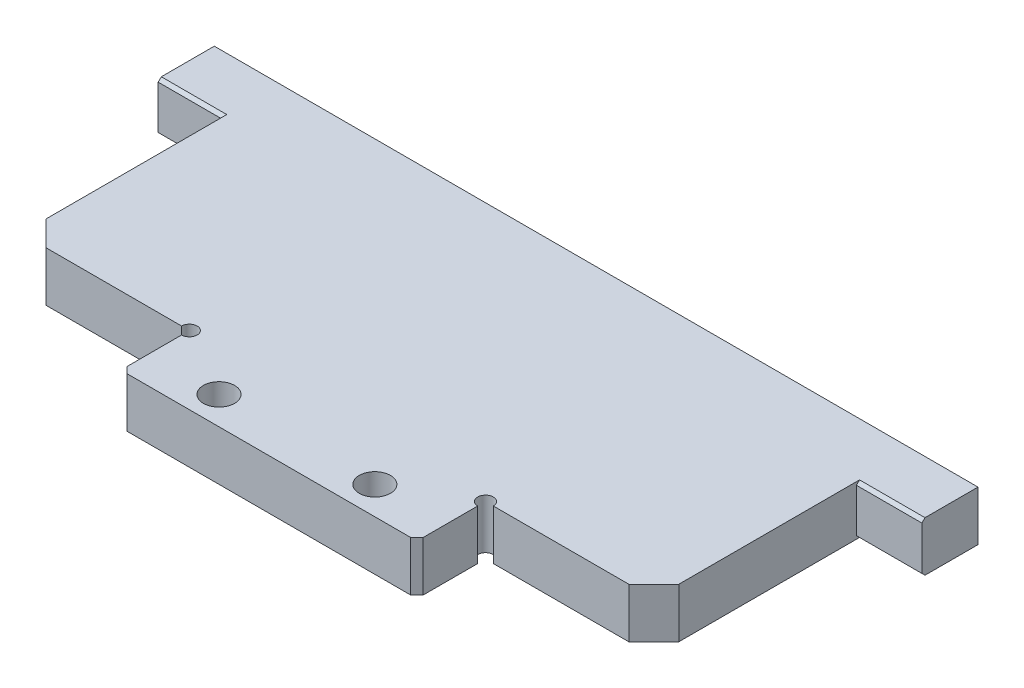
ISO-10303-21;
HEADER;
FILE_DESCRIPTION(('STEP AP214'),'2;1');
FILE_NAME('part.step','',(''),(''),'','','');
FILE_SCHEMA(('AUTOMOTIVE_DESIGN { 1 0 10303 214 1 1 1 1 }'));
ENDSEC;
DATA;
#1=APPLICATION_CONTEXT('core data for automotive mechanical design processes');
#2=APPLICATION_PROTOCOL_DEFINITION('international standard','automotive_design',2000,#1);
#3=PRODUCT_CONTEXT('',#1,'mechanical');
#4=PRODUCT('Part','Part','',(#3));
#5=PRODUCT_RELATED_PRODUCT_CATEGORY('part','',(#4));
#6=PRODUCT_DEFINITION_FORMATION('','',#4);
#7=PRODUCT_DEFINITION_CONTEXT('part definition',#1,'design');
#8=PRODUCT_DEFINITION('design','',#6,#7);
#9=PRODUCT_DEFINITION_SHAPE('','',#8);
#10=(LENGTH_UNIT() NAMED_UNIT(*) SI_UNIT(.MILLI.,.METRE.));
#11=(NAMED_UNIT(*) PLANE_ANGLE_UNIT() SI_UNIT($,.RADIAN.));
#12=(NAMED_UNIT(*) SI_UNIT($,.STERADIAN.) SOLID_ANGLE_UNIT());
#13=UNCERTAINTY_MEASURE_WITH_UNIT(LENGTH_MEASURE(1.E-05),#10,'distance_accuracy_value','');
#14=(GEOMETRIC_REPRESENTATION_CONTEXT(3) GLOBAL_UNCERTAINTY_ASSIGNED_CONTEXT((#13)) GLOBAL_UNIT_ASSIGNED_CONTEXT((#10,
#11,#12)) REPRESENTATION_CONTEXT('',''));
#15=CARTESIAN_POINT('',(0.,0.,0.));
#16=DIRECTION('',(0.,0.,1.));
#17=DIRECTION('',(1.,0.,0.));
#18=AXIS2_PLACEMENT_3D('',#15,#16,#17);
#19=CARTESIAN_POINT('',(-122.5,16.,-105.));
#20=DIRECTION('',(1.,0.,0.));
#21=DIRECTION('',(0.,0.,-1.));
#22=AXIS2_PLACEMENT_3D('',#19,#20,#21);
#23=PLANE('',#22);
#24=DIRECTION('',(0.,0.,1.));
#25=VECTOR('',#24,1.);
#26=CARTESIAN_POINT('',(-122.5,0.,-105.));
#27=LINE('',#26,#25);
#28=CARTESIAN_POINT('',(-122.5,0.,-105.));
#29=VERTEX_POINT('',#28);
#30=CARTESIAN_POINT('',(-122.5,0.,-88.));
#31=VERTEX_POINT('',#30);
#32=EDGE_CURVE('E250',#29,#31,#27,.T.);
#33=ORIENTED_EDGE('',*,*,#32,.T.);
#34=DIRECTION('',(0.,-0.707106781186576,-0.707106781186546));
#35=VECTOR('',#34,1.);
#36=CARTESIAN_POINT('',(-122.5,0.,-88.));
#37=LINE('',#36,#35);
#38=CARTESIAN_POINT('',(-122.5,1.,-87.));
#39=VERTEX_POINT('',#38);
#40=EDGE_CURVE('E348',#31,#39,#37,.F.);
#41=ORIENTED_EDGE('',*,*,#40,.T.);
#42=DIRECTION('',(0.,1.00000000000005,0.));
#43=VECTOR('',#42,1.);
#44=CARTESIAN_POINT('',(-122.5,0.,-87.));
#45=LINE('',#44,#43);
#46=CARTESIAN_POINT('',(-122.5,15.,-87.));
#47=VERTEX_POINT('',#46);
#48=EDGE_CURVE('E416',#39,#47,#45,.T.);
#49=ORIENTED_EDGE('',*,*,#48,.T.);
#50=DIRECTION('',(0.,0.707106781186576,-0.707106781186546));
#51=VECTOR('',#50,1.);
#52=CARTESIAN_POINT('',(-122.5,15.,-87.));
#53=LINE('',#52,#51);
#54=CARTESIAN_POINT('',(-122.5,16.,-88.));
#55=VERTEX_POINT('',#54);
#56=EDGE_CURVE('E346',#47,#55,#53,.T.);
#57=ORIENTED_EDGE('',*,*,#56,.T.);
#58=DIRECTION('',(0.,0.,1.));
#59=VECTOR('',#58,1.);
#60=CARTESIAN_POINT('',(-122.5,16.,-105.));
#61=LINE('',#60,#59);
#62=CARTESIAN_POINT('',(-122.5,16.,-105.));
#63=VERTEX_POINT('',#62);
#64=EDGE_CURVE('E255',#63,#55,#61,.T.);
#65=ORIENTED_EDGE('',*,*,#64,.F.);
#66=DIRECTION('',(0.,-1.00000000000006,0.));
#67=VECTOR('',#66,1.);
#68=CARTESIAN_POINT('',(-122.5,16.,-105.));
#69=LINE('',#68,#67);
#70=EDGE_CURVE('E267',#63,#29,#69,.T.);
#71=ORIENTED_EDGE('',*,*,#70,.T.);
#72=EDGE_LOOP('',(#33,#41,#49,#57,#65,#71));
#73=FACE_BOUND('',#72,.T.);
#74=ADVANCED_FACE('F54',(#73),#23,.F.);
#75=CARTESIAN_POINT('',(-122.5,16.,0.));
#76=DIRECTION('',(0.,0.,-1.));
#77=DIRECTION('',(-1.,0.,0.));
#78=AXIS2_PLACEMENT_3D('',#75,#76,#77);
#79=PLANE('',#78);
#80=DIRECTION('',(1.,0.,0.));
#81=VECTOR('',#80,1.);
#82=CARTESIAN_POINT('',(-122.5,16.,0.));
#83=LINE('',#82,#81);
#84=CARTESIAN_POINT('',(-45.5,16.,0.));
#85=VERTEX_POINT('',#84);
#86=CARTESIAN_POINT('',(45.5,16.,1.59160878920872E-13));
#87=VERTEX_POINT('',#86);
#88=EDGE_CURVE('E258',#85,#87,#83,.T.);
#89=ORIENTED_EDGE('',*,*,#88,.F.);
#90=DIRECTION('',(0.,-1.00000000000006,0.));
#91=VECTOR('',#90,1.);
#92=CARTESIAN_POINT('',(-45.5,16.,0.));
#93=LINE('',#92,#91);
#94=CARTESIAN_POINT('',(-45.5000000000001,0.,0.));
#95=VERTEX_POINT('',#94);
#96=EDGE_CURVE('E295',#85,#95,#93,.T.);
#97=ORIENTED_EDGE('',*,*,#96,.T.);
#98=DIRECTION('',(1.,0.,0.));
#99=VECTOR('',#98,1.);
#100=CARTESIAN_POINT('',(-122.5,0.,-1.0842021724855E-13));
#101=LINE('',#100,#99);
#102=CARTESIAN_POINT('',(45.5,0.,0.));
#103=VERTEX_POINT('',#102);
#104=EDGE_CURVE('E270',#95,#103,#101,.T.);
#105=ORIENTED_EDGE('',*,*,#104,.T.);
#106=DIRECTION('',(0.,1.00000000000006,0.));
#107=VECTOR('',#106,1.);
#108=CARTESIAN_POINT('',(45.5,16.,1.62630325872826E-13));
#109=LINE('',#108,#107);
#110=EDGE_CURVE('E292',#103,#87,#109,.T.);
#111=ORIENTED_EDGE('',*,*,#110,.T.);
#112=EDGE_LOOP('',(#89,#97,#105,#111));
#113=FACE_BOUND('',#112,.T.);
#114=ADVANCED_FACE('F443',(#113),#79,.F.);
#115=CARTESIAN_POINT('',(122.5,16.,-105.));
#116=DIRECTION('',(-1.,0.,0.));
#117=DIRECTION('',(0.,0.,1.));
#118=AXIS2_PLACEMENT_3D('',#115,#116,#117);
#119=PLANE('',#118);
#120=DIRECTION('',(0.,1.00000000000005,0.));
#121=VECTOR('',#120,1.);
#122=CARTESIAN_POINT('',(122.5,0.,-86.9999999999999));
#123=LINE('',#122,#121);
#124=CARTESIAN_POINT('',(122.5,1.,-86.9999999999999));
#125=VERTEX_POINT('',#124);
#126=CARTESIAN_POINT('',(122.5,15.,-86.9999999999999));
#127=VERTEX_POINT('',#126);
#128=EDGE_CURVE('E405',#125,#127,#123,.T.);
#129=ORIENTED_EDGE('',*,*,#128,.F.);
#130=DIRECTION('',(0.,0.707106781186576,0.707106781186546));
#131=VECTOR('',#130,1.);
#132=CARTESIAN_POINT('',(122.5,0.,-87.9999999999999));
#133=LINE('',#132,#131);
#134=CARTESIAN_POINT('',(122.5,0.,-88.));
#135=VERTEX_POINT('',#134);
#136=EDGE_CURVE('E338',#125,#135,#133,.F.);
#137=ORIENTED_EDGE('',*,*,#136,.T.);
#138=DIRECTION('',(0.,0.,-1.));
#139=VECTOR('',#138,1.);
#140=CARTESIAN_POINT('',(122.5,0.,-105.));
#141=LINE('',#140,#139);
#142=CARTESIAN_POINT('',(122.5,0.,-105.));
#143=VERTEX_POINT('',#142);
#144=EDGE_CURVE('E273',#135,#143,#141,.T.);
#145=ORIENTED_EDGE('',*,*,#144,.T.);
#146=DIRECTION('',(0.,-1.00000000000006,0.));
#147=VECTOR('',#146,1.);
#148=CARTESIAN_POINT('',(122.5,16.,-105.));
#149=LINE('',#148,#147);
#150=CARTESIAN_POINT('',(122.5,16.,-105.));
#151=VERTEX_POINT('',#150);
#152=EDGE_CURVE('E279',#151,#143,#149,.T.);
#153=ORIENTED_EDGE('',*,*,#152,.F.);
#154=DIRECTION('',(0.,0.,-1.));
#155=VECTOR('',#154,1.);
#156=CARTESIAN_POINT('',(122.5,16.,-105.));
#157=LINE('',#156,#155);
#158=CARTESIAN_POINT('',(122.5,16.,-88.));
#159=VERTEX_POINT('',#158);
#160=EDGE_CURVE('E261',#159,#151,#157,.T.);
#161=ORIENTED_EDGE('',*,*,#160,.F.);
#162=DIRECTION('',(0.,-0.707106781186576,0.707106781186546));
#163=VECTOR('',#162,1.);
#164=CARTESIAN_POINT('',(122.5,15.,-86.9999999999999));
#165=LINE('',#164,#163);
#166=EDGE_CURVE('E335',#159,#127,#165,.T.);
#167=ORIENTED_EDGE('',*,*,#166,.T.);
#168=EDGE_LOOP('',(#129,#137,#145,#153,#161,#167));
#169=FACE_BOUND('',#168,.T.);
#170=ADVANCED_FACE('F488',(#169),#119,.F.);
#171=CARTESIAN_POINT('',(-122.5,16.,-105.));
#172=DIRECTION('',(0.,0.,1.));
#173=DIRECTION('',(1.,0.,0.));
#174=AXIS2_PLACEMENT_3D('',#171,#172,#173);
#175=PLANE('',#174);
#176=DIRECTION('',(-1.,0.,0.));
#177=VECTOR('',#176,1.);
#178=CARTESIAN_POINT('',(-122.5,0.,-105.));
#179=LINE('',#178,#177);
#180=EDGE_CURVE('E259',#143,#29,#179,.T.);
#181=ORIENTED_EDGE('',*,*,#180,.T.);
#182=ORIENTED_EDGE('',*,*,#70,.F.);
#183=DIRECTION('',(-1.,0.,0.));
#184=VECTOR('',#183,1.);
#185=CARTESIAN_POINT('',(-122.5,16.,-105.));
#186=LINE('',#185,#184);
#187=EDGE_CURVE('E264',#151,#63,#186,.T.);
#188=ORIENTED_EDGE('',*,*,#187,.F.);
#189=ORIENTED_EDGE('',*,*,#152,.T.);
#190=EDGE_LOOP('',(#181,#182,#188,#189));
#191=FACE_BOUND('',#190,.T.);
#192=ADVANCED_FACE('F381',(#191),#175,.F.);
#193=CARTESIAN_POINT('',(0.,16.,1.0842021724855E-13));
#194=DIRECTION('',(0.,1.00000000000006,0.));
#195=DIRECTION('',(0.,0.,1.));
#196=AXIS2_PLACEMENT_3D('',#193,#194,#195);
#197=PLANE('',#196);
#198=DIRECTION('',(0.,0.,1.));
#199=VECTOR('',#198,1.);
#200=CARTESIAN_POINT('',(101.5,16.,-21.9999999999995));
#201=LINE('',#200,#199);
#202=CARTESIAN_POINT('',(101.5,16.,-88.));
#203=VERTEX_POINT('',#202);
#204=CARTESIAN_POINT('',(101.5,16.,-30.));
#205=VERTEX_POINT('',#204);
#206=EDGE_CURVE('E412',#203,#205,#201,.T.);
#207=ORIENTED_EDGE('',*,*,#206,.F.);
#208=DIRECTION('',(1.,0.,0.));
#209=VECTOR('',#208,1.);
#210=CARTESIAN_POINT('',(122.5,16.,-88.));
#211=LINE('',#210,#209);
#212=EDGE_CURVE('E343',#203,#159,#211,.T.);
#213=ORIENTED_EDGE('',*,*,#212,.T.);
#214=ORIENTED_EDGE('',*,*,#160,.T.);
#215=ORIENTED_EDGE('',*,*,#187,.T.);
#216=ORIENTED_EDGE('',*,*,#64,.T.);
#217=DIRECTION('',(1.,0.,0.));
#218=VECTOR('',#217,1.);
#219=CARTESIAN_POINT('',(-101.5,16.,-88.));
#220=LINE('',#219,#218);
#221=CARTESIAN_POINT('',(-101.5,16.,-88.));
#222=VERTEX_POINT('',#221);
#223=EDGE_CURVE('E340',#55,#222,#220,.T.);
#224=ORIENTED_EDGE('',*,*,#223,.T.);
#225=DIRECTION('',(0.,0.,-1.));
#226=VECTOR('',#225,1.);
#227=CARTESIAN_POINT('',(-101.5,16.,-22.));
#228=LINE('',#227,#226);
#229=CARTESIAN_POINT('',(-101.5,16.,-29.9999999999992));
#230=VERTEX_POINT('',#229);
#231=EDGE_CURVE('E404',#230,#222,#228,.T.);
#232=ORIENTED_EDGE('',*,*,#231,.F.);
#233=DIRECTION('',(-0.707106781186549,0.,-0.707106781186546));
#234=VECTOR('',#233,1.);
#235=CARTESIAN_POINT('',(-35.7499999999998,16.,35.7499999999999));
#236=LINE('',#235,#234);
#237=CARTESIAN_POINT('',(-93.4999999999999,16.,-22.));
#238=VERTEX_POINT('',#237);
#239=EDGE_CURVE('E306',#230,#238,#236,.F.);
#240=ORIENTED_EDGE('',*,*,#239,.T.);
#241=DIRECTION('',(-1.,0.,0.));
#242=VECTOR('',#241,1.);
#243=CARTESIAN_POINT('',(-122.5,16.,-22.));
#244=LINE('',#243,#242);
#245=CARTESIAN_POINT('',(-50.,16.,-22.));
#246=VERTEX_POINT('',#245);
#247=EDGE_CURVE('E247',#246,#238,#244,.T.);
#248=ORIENTED_EDGE('',*,*,#247,.F.);
#249=CARTESIAN_POINT('',(-47.5,16.,-22.));
#250=DIRECTION('',(0.,1.00000000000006,0.));
#251=DIRECTION('',(0.,0.,1.));
#252=AXIS2_PLACEMENT_3D('',#249,#250,#251);
#253=CIRCLE('',#252,2.50000000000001);
#254=CARTESIAN_POINT('',(-47.5,16.,-19.5));
#255=VERTEX_POINT('',#254);
#256=EDGE_CURVE('E230',#255,#246,#253,.T.);
#257=ORIENTED_EDGE('',*,*,#256,.F.);
#258=DIRECTION('',(0.,0.,-1.));
#259=VECTOR('',#258,1.);
#260=CARTESIAN_POINT('',(-47.5,16.,0.));
#261=LINE('',#260,#259);
#262=CARTESIAN_POINT('',(-47.5,16.,-1.9999999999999));
#263=VERTEX_POINT('',#262);
#264=EDGE_CURVE('E251',#263,#255,#261,.T.);
#265=ORIENTED_EDGE('',*,*,#264,.F.);
#266=DIRECTION('',(-0.707106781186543,0.,-0.707106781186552));
#267=VECTOR('',#266,1.);
#268=CARTESIAN_POINT('',(-22.7500000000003,16.,22.75));
#269=LINE('',#268,#267);
#270=EDGE_CURVE('E290',#263,#85,#269,.F.);
#271=ORIENTED_EDGE('',*,*,#270,.T.);
#272=ORIENTED_EDGE('',*,*,#88,.T.);
#273=DIRECTION('',(-0.707106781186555,0.,0.70710678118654));
#274=VECTOR('',#273,1.);
#275=CARTESIAN_POINT('',(22.7499999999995,16.,22.75));
#276=LINE('',#275,#274);
#277=CARTESIAN_POINT('',(47.5,16.,-1.99999999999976));
#278=VERTEX_POINT('',#277);
#279=EDGE_CURVE('E235',#87,#278,#276,.F.);
#280=ORIENTED_EDGE('',*,*,#279,.T.);
#281=DIRECTION('',(0.,0.,1.));
#282=VECTOR('',#281,1.);
#283=CARTESIAN_POINT('',(47.5,16.,1.62630325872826E-13));
#284=LINE('',#283,#282);
#285=CARTESIAN_POINT('',(47.5,16.,-19.5));
#286=VERTEX_POINT('',#285);
#287=EDGE_CURVE('E226',#286,#278,#284,.T.);
#288=ORIENTED_EDGE('',*,*,#287,.F.);
#289=CARTESIAN_POINT('',(47.5,16.,-22.));
#290=DIRECTION('',(0.,1.00000000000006,0.));
#291=DIRECTION('',(0.,0.,1.));
#292=AXIS2_PLACEMENT_3D('',#289,#290,#291);
#293=CIRCLE('',#292,2.50000000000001);
#294=CARTESIAN_POINT('',(50.,16.,-22.));
#295=VERTEX_POINT('',#294);
#296=EDGE_CURVE('E208',#295,#286,#293,.T.);
#297=ORIENTED_EDGE('',*,*,#296,.F.);
#298=DIRECTION('',(-1.,0.,0.));
#299=VECTOR('',#298,1.);
#300=CARTESIAN_POINT('',(122.5,16.,-22.));
#301=LINE('',#300,#299);
#302=CARTESIAN_POINT('',(93.5000000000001,16.,-21.9999999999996));
#303=VERTEX_POINT('',#302);
#304=EDGE_CURVE('E237',#303,#295,#301,.T.);
#305=ORIENTED_EDGE('',*,*,#304,.F.);
#306=DIRECTION('',(-0.707106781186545,0.,0.70710678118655));
#307=VECTOR('',#306,1.);
#308=CARTESIAN_POINT('',(35.7500000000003,16.,35.7500000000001));
#309=LINE('',#308,#307);
#310=EDGE_CURVE('E308',#303,#205,#309,.F.);
#311=ORIENTED_EDGE('',*,*,#310,.T.);
#312=EDGE_LOOP('',(#207,#213,#214,#215,#216,#224,#232,#240,#248,#257,#265,#271,#272,#280,#288,
#297,#305,#311));
#313=FACE_BOUND('',#312,.T.);
#314=CARTESIAN_POINT('',(25.,16.,-9.));
#315=DIRECTION('',(0.,1.00000000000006,0.));
#316=DIRECTION('',(0.,0.,1.));
#317=AXIS2_PLACEMENT_3D('',#314,#315,#316);
#318=CIRCLE('',#317,5.);
#319=CARTESIAN_POINT('',(25.,16.,-4.));
#320=VERTEX_POINT('',#319);
#321=EDGE_CURVE('E418',#320,#320,#318,.T.);
#322=ORIENTED_EDGE('',*,*,#321,.F.);
#323=EDGE_LOOP('',(#322));
#324=FACE_BOUND('',#323,.T.);
#325=CARTESIAN_POINT('',(-25.,16.,-9.));
#326=DIRECTION('',(0.,1.00000000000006,0.));
#327=DIRECTION('',(0.,0.,1.));
#328=AXIS2_PLACEMENT_3D('',#325,#326,#327);
#329=CIRCLE('',#328,5.);
#330=CARTESIAN_POINT('',(-25.,16.,-4.));
#331=VERTEX_POINT('',#330);
#332=EDGE_CURVE('E423',#331,#331,#329,.T.);
#333=ORIENTED_EDGE('',*,*,#332,.F.);
#334=EDGE_LOOP('',(#333));
#335=FACE_BOUND('',#334,.T.);
#336=ADVANCED_FACE('F232',(#313,#324,#335),#197,.T.);
#337=CARTESIAN_POINT('',(0.,0.,0.));
#338=DIRECTION('',(0.,1.00000000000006,0.));
#339=DIRECTION('',(0.,0.,1.));
#340=AXIS2_PLACEMENT_3D('',#337,#338,#339);
#341=PLANE('',#340);
#342=CARTESIAN_POINT('',(25.,0.,-9.));
#343=DIRECTION('',(0.,1.00000000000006,0.));
#344=DIRECTION('',(0.,0.,1.));
#345=AXIS2_PLACEMENT_3D('',#342,#343,#344);
#346=CIRCLE('',#345,5.);
#347=CARTESIAN_POINT('',(25.,0.,-4.));
#348=VERTEX_POINT('',#347);
#349=EDGE_CURVE('E420',#348,#348,#346,.T.);
#350=ORIENTED_EDGE('',*,*,#349,.T.);
#351=EDGE_LOOP('',(#350));
#352=FACE_BOUND('',#351,.T.);
#353=CARTESIAN_POINT('',(-25.,0.,-9.));
#354=DIRECTION('',(0.,1.00000000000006,0.));
#355=DIRECTION('',(0.,0.,1.));
#356=AXIS2_PLACEMENT_3D('',#353,#354,#355);
#357=CIRCLE('',#356,5.);
#358=CARTESIAN_POINT('',(-25.,0.,-4.));
#359=VERTEX_POINT('',#358);
#360=EDGE_CURVE('E220',#359,#359,#357,.T.);
#361=ORIENTED_EDGE('',*,*,#360,.T.);
#362=EDGE_LOOP('',(#361));
#363=FACE_BOUND('',#362,.T.);
#364=ORIENTED_EDGE('',*,*,#144,.F.);
#365=DIRECTION('',(-1.,0.,0.));
#366=VECTOR('',#365,1.);
#367=CARTESIAN_POINT('',(0.,0.,-87.9999999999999));
#368=LINE('',#367,#366);
#369=CARTESIAN_POINT('',(101.5,0.,-87.9999999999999));
#370=VERTEX_POINT('',#369);
#371=EDGE_CURVE('E324',#135,#370,#368,.T.);
#372=ORIENTED_EDGE('',*,*,#371,.T.);
#373=DIRECTION('',(0.,0.,1.));
#374=VECTOR('',#373,1.);
#375=CARTESIAN_POINT('',(101.5,0.,-22.));
#376=LINE('',#375,#374);
#377=CARTESIAN_POINT('',(101.5,0.,-30.0000000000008));
#378=VERTEX_POINT('',#377);
#379=EDGE_CURVE('E397',#370,#378,#376,.T.);
#380=ORIENTED_EDGE('',*,*,#379,.T.);
#381=DIRECTION('',(0.707106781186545,0.,-0.70710678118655));
#382=VECTOR('',#381,1.);
#383=CARTESIAN_POINT('',(93.5,0.,-21.9999999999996));
#384=LINE('',#383,#382);
#385=CARTESIAN_POINT('',(93.5000000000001,0.,-21.9999999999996));
#386=VERTEX_POINT('',#385);
#387=EDGE_CURVE('E314',#378,#386,#384,.F.);
#388=ORIENTED_EDGE('',*,*,#387,.T.);
#389=DIRECTION('',(-1.,0.,0.));
#390=VECTOR('',#389,1.);
#391=CARTESIAN_POINT('',(122.5,0.,-22.));
#392=LINE('',#391,#390);
#393=CARTESIAN_POINT('',(50.,0.,-22.));
#394=VERTEX_POINT('',#393);
#395=EDGE_CURVE('E236',#386,#394,#392,.T.);
#396=ORIENTED_EDGE('',*,*,#395,.T.);
#397=CARTESIAN_POINT('',(47.5,0.,-22.));
#398=DIRECTION('',(0.,1.00000000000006,0.));
#399=DIRECTION('',(0.,0.,1.));
#400=AXIS2_PLACEMENT_3D('',#397,#398,#399);
#401=CIRCLE('',#400,2.50000000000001);
#402=CARTESIAN_POINT('',(47.5,0.,-19.5));
#403=VERTEX_POINT('',#402);
#404=EDGE_CURVE('E219',#394,#403,#401,.T.);
#405=ORIENTED_EDGE('',*,*,#404,.T.);
#406=DIRECTION('',(0.,0.,1.));
#407=VECTOR('',#406,1.);
#408=CARTESIAN_POINT('',(47.5,0.,0.));
#409=LINE('',#408,#407);
#410=CARTESIAN_POINT('',(47.5,0.,-1.99999999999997));
#411=VERTEX_POINT('',#410);
#412=EDGE_CURVE('E229',#403,#411,#409,.T.);
#413=ORIENTED_EDGE('',*,*,#412,.T.);
#414=DIRECTION('',(0.707106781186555,0.,-0.70710678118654));
#415=VECTOR('',#414,1.);
#416=CARTESIAN_POINT('',(45.5,0.,0.));
#417=LINE('',#416,#415);
#418=EDGE_CURVE('E297',#411,#103,#417,.F.);
#419=ORIENTED_EDGE('',*,*,#418,.T.);
#420=ORIENTED_EDGE('',*,*,#104,.F.);
#421=DIRECTION('',(0.707106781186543,0.,0.707106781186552));
#422=VECTOR('',#421,1.);
#423=CARTESIAN_POINT('',(-47.5,0.,-2.));
#424=LINE('',#423,#422);
#425=CARTESIAN_POINT('',(-47.5,0.,-2.));
#426=VERTEX_POINT('',#425);
#427=EDGE_CURVE('E299',#95,#426,#424,.F.);
#428=ORIENTED_EDGE('',*,*,#427,.T.);
#429=DIRECTION('',(0.,0.,-1.));
#430=VECTOR('',#429,1.);
#431=CARTESIAN_POINT('',(-47.5,0.,0.));
#432=LINE('',#431,#430);
#433=CARTESIAN_POINT('',(-47.5,0.,-19.5));
#434=VERTEX_POINT('',#433);
#435=EDGE_CURVE('E244',#426,#434,#432,.T.);
#436=ORIENTED_EDGE('',*,*,#435,.T.);
#437=CARTESIAN_POINT('',(-47.5,0.,-22.));
#438=DIRECTION('',(0.,1.00000000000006,0.));
#439=DIRECTION('',(0.,0.,1.));
#440=AXIS2_PLACEMENT_3D('',#437,#438,#439);
#441=CIRCLE('',#440,2.50000000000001);
#442=CARTESIAN_POINT('',(-50.,0.,-22.));
#443=VERTEX_POINT('',#442);
#444=EDGE_CURVE('E431',#434,#443,#441,.T.);
#445=ORIENTED_EDGE('',*,*,#444,.T.);
#446=DIRECTION('',(-1.,0.,0.));
#447=VECTOR('',#446,1.);
#448=CARTESIAN_POINT('',(-122.5,0.,-22.));
#449=LINE('',#448,#447);
#450=CARTESIAN_POINT('',(-93.4999999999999,0.,-22.0000000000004));
#451=VERTEX_POINT('',#450);
#452=EDGE_CURVE('E246',#443,#451,#449,.T.);
#453=ORIENTED_EDGE('',*,*,#452,.T.);
#454=DIRECTION('',(0.707106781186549,0.,0.707106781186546));
#455=VECTOR('',#454,1.);
#456=CARTESIAN_POINT('',(-101.5,0.,-30.));
#457=LINE('',#456,#455);
#458=CARTESIAN_POINT('',(-101.5,0.,-30.));
#459=VERTEX_POINT('',#458);
#460=EDGE_CURVE('E312',#451,#459,#457,.F.);
#461=ORIENTED_EDGE('',*,*,#460,.T.);
#462=DIRECTION('',(0.,0.,-1.));
#463=VECTOR('',#462,1.);
#464=CARTESIAN_POINT('',(-101.5,0.,-22.));
#465=LINE('',#464,#463);
#466=CARTESIAN_POINT('',(-101.5,0.,-88.));
#467=VERTEX_POINT('',#466);
#468=EDGE_CURVE('E365',#459,#467,#465,.T.);
#469=ORIENTED_EDGE('',*,*,#468,.T.);
#470=DIRECTION('',(-1.,0.,0.));
#471=VECTOR('',#470,1.);
#472=CARTESIAN_POINT('',(0.,0.,-88.));
#473=LINE('',#472,#471);
#474=EDGE_CURVE('E321',#467,#31,#473,.T.);
#475=ORIENTED_EDGE('',*,*,#474,.T.);
#476=ORIENTED_EDGE('',*,*,#32,.F.);
#477=ORIENTED_EDGE('',*,*,#180,.F.);
#478=EDGE_LOOP('',(#364,#372,#380,#388,#396,#405,#413,#419,#420,#428,#436,#445,#453,#461,#469,
#475,#476,#477));
#479=FACE_BOUND('',#478,.T.);
#480=ADVANCED_FACE('F373',(#352,#363,#479),#341,.F.);
#481=CARTESIAN_POINT('',(-122.5,0.,-22.));
#482=DIRECTION('',(0.,0.,-1.));
#483=DIRECTION('',(-1.,0.,0.));
#484=AXIS2_PLACEMENT_3D('',#481,#482,#483);
#485=PLANE('',#484);
#486=ORIENTED_EDGE('',*,*,#247,.T.);
#487=DIRECTION('',(0.,-1.00000000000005,0.));
#488=VECTOR('',#487,1.);
#489=CARTESIAN_POINT('',(-93.4999999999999,0.,-22.0000000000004));
#490=LINE('',#489,#488);
#491=EDGE_CURVE('E319',#238,#451,#490,.T.);
#492=ORIENTED_EDGE('',*,*,#491,.T.);
#493=ORIENTED_EDGE('',*,*,#452,.F.);
#494=DIRECTION('',(0.,1.00000000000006,0.));
#495=VECTOR('',#494,1.);
#496=CARTESIAN_POINT('',(-50.,0.,-22.));
#497=LINE('',#496,#495);
#498=EDGE_CURVE('E240',#443,#246,#497,.T.);
#499=ORIENTED_EDGE('',*,*,#498,.T.);
#500=EDGE_LOOP('',(#486,#492,#493,#499));
#501=FACE_BOUND('',#500,.T.);
#502=ADVANCED_FACE('F461',(#501),#485,.F.);
#503=CARTESIAN_POINT('',(-47.5,0.,0.));
#504=DIRECTION('',(1.,0.,0.));
#505=DIRECTION('',(0.,0.,-1.));
#506=AXIS2_PLACEMENT_3D('',#503,#504,#505);
#507=PLANE('',#506);
#508=ORIENTED_EDGE('',*,*,#435,.F.);
#509=DIRECTION('',(0.,1.00000000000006,0.));
#510=VECTOR('',#509,1.);
#511=CARTESIAN_POINT('',(-47.5,0.,-2.));
#512=LINE('',#511,#510);
#513=EDGE_CURVE('E286',#426,#263,#512,.T.);
#514=ORIENTED_EDGE('',*,*,#513,.T.);
#515=ORIENTED_EDGE('',*,*,#264,.T.);
#516=DIRECTION('',(0.,1.00000000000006,0.));
#517=VECTOR('',#516,1.);
#518=CARTESIAN_POINT('',(-47.5,0.,-19.5));
#519=LINE('',#518,#517);
#520=EDGE_CURVE('E282',#255,#434,#519,.F.);
#521=ORIENTED_EDGE('',*,*,#520,.T.);
#522=EDGE_LOOP('',(#508,#514,#515,#521));
#523=FACE_BOUND('',#522,.T.);
#524=ADVANCED_FACE('F453',(#523),#507,.F.);
#525=CARTESIAN_POINT('',(47.5,0.,0.));
#526=DIRECTION('',(-1.,0.,0.));
#527=DIRECTION('',(0.,0.,1.));
#528=AXIS2_PLACEMENT_3D('',#525,#526,#527);
#529=PLANE('',#528);
#530=ORIENTED_EDGE('',*,*,#287,.T.);
#531=DIRECTION('',(0.,-1.00000000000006,0.));
#532=VECTOR('',#531,1.);
#533=CARTESIAN_POINT('',(47.5,0.,-1.99999999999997));
#534=LINE('',#533,#532);
#535=EDGE_CURVE('E301',#278,#411,#534,.T.);
#536=ORIENTED_EDGE('',*,*,#535,.T.);
#537=ORIENTED_EDGE('',*,*,#412,.F.);
#538=DIRECTION('',(0.,1.00000000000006,0.));
#539=VECTOR('',#538,1.);
#540=CARTESIAN_POINT('',(47.5,0.,-19.5));
#541=LINE('',#540,#539);
#542=EDGE_CURVE('E212',#403,#286,#541,.T.);
#543=ORIENTED_EDGE('',*,*,#542,.T.);
#544=EDGE_LOOP('',(#530,#536,#537,#543));
#545=FACE_BOUND('',#544,.T.);
#546=ADVANCED_FACE('F225',(#545),#529,.F.);
#547=CARTESIAN_POINT('',(122.5,0.,-22.));
#548=DIRECTION('',(0.,0.,-1.));
#549=DIRECTION('',(-1.,0.,0.));
#550=AXIS2_PLACEMENT_3D('',#547,#548,#549);
#551=PLANE('',#550);
#552=ORIENTED_EDGE('',*,*,#395,.F.);
#553=DIRECTION('',(0.,1.00000000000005,0.));
#554=VECTOR('',#553,1.);
#555=CARTESIAN_POINT('',(93.5,0.,-21.9999999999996));
#556=LINE('',#555,#554);
#557=EDGE_CURVE('E303',#386,#303,#556,.T.);
#558=ORIENTED_EDGE('',*,*,#557,.T.);
#559=ORIENTED_EDGE('',*,*,#304,.T.);
#560=DIRECTION('',(0.,1.00000000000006,0.));
#561=VECTOR('',#560,1.);
#562=CARTESIAN_POINT('',(50.,0.,-22.));
#563=LINE('',#562,#561);
#564=EDGE_CURVE('E215',#295,#394,#563,.F.);
#565=ORIENTED_EDGE('',*,*,#564,.T.);
#566=EDGE_LOOP('',(#552,#558,#559,#565));
#567=FACE_BOUND('',#566,.T.);
#568=ADVANCED_FACE('F581',(#567),#551,.F.);
#569=CARTESIAN_POINT('',(-47.5,0.,-22.));
#570=DIRECTION('',(0.,1.00000000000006,0.));
#571=DIRECTION('',(0.,0.,1.));
#572=AXIS2_PLACEMENT_3D('',#569,#570,#571);
#573=CYLINDRICAL_SURFACE('',#572,2.50000000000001);
#574=ORIENTED_EDGE('',*,*,#444,.F.);
#575=ORIENTED_EDGE('',*,*,#520,.F.);
#576=ORIENTED_EDGE('',*,*,#256,.T.);
#577=ORIENTED_EDGE('',*,*,#498,.F.);
#578=EDGE_LOOP('',(#574,#575,#576,#577));
#579=FACE_BOUND('',#578,.T.);
#580=ADVANCED_FACE('F458',(#579),#573,.F.);
#581=CARTESIAN_POINT('',(47.5,0.,-22.));
#582=DIRECTION('',(0.,1.00000000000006,0.));
#583=DIRECTION('',(0.,0.,1.));
#584=AXIS2_PLACEMENT_3D('',#581,#582,#583);
#585=CYLINDRICAL_SURFACE('',#584,2.50000000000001);
#586=ORIENTED_EDGE('',*,*,#404,.F.);
#587=ORIENTED_EDGE('',*,*,#564,.F.);
#588=ORIENTED_EDGE('',*,*,#296,.T.);
#589=ORIENTED_EDGE('',*,*,#542,.F.);
#590=EDGE_LOOP('',(#586,#587,#588,#589));
#591=FACE_BOUND('',#590,.T.);
#592=ADVANCED_FACE('F211',(#591),#585,.F.);
#593=CARTESIAN_POINT('',(-47.5,0.,-2.));
#594=DIRECTION('',(0.707106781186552,0.,-0.707106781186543));
#595=DIRECTION('',(0.,1.00000000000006,0.));
#596=AXIS2_PLACEMENT_3D('',#593,#594,#595);
#597=PLANE('',#596);
#598=ORIENTED_EDGE('',*,*,#427,.F.);
#599=ORIENTED_EDGE('',*,*,#96,.F.);
#600=ORIENTED_EDGE('',*,*,#270,.F.);
#601=ORIENTED_EDGE('',*,*,#513,.F.);
#602=EDGE_LOOP('',(#598,#599,#600,#601));
#603=FACE_BOUND('',#602,.T.);
#604=ADVANCED_FACE('F450',(#603),#597,.F.);
#605=CARTESIAN_POINT('',(45.5,16.,1.62630325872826E-13));
#606=DIRECTION('',(-0.70710678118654,0.,-0.707106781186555));
#607=DIRECTION('',(0.,1.00000000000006,0.));
#608=AXIS2_PLACEMENT_3D('',#605,#606,#607);
#609=PLANE('',#608);
#610=ORIENTED_EDGE('',*,*,#418,.F.);
#611=ORIENTED_EDGE('',*,*,#535,.F.);
#612=ORIENTED_EDGE('',*,*,#279,.F.);
#613=ORIENTED_EDGE('',*,*,#110,.F.);
#614=EDGE_LOOP('',(#610,#611,#612,#613));
#615=FACE_BOUND('',#614,.T.);
#616=ADVANCED_FACE('F440',(#615),#609,.F.);
#617=CARTESIAN_POINT('',(-25.,0.,-9.));
#618=DIRECTION('',(0.,1.00000000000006,0.));
#619=DIRECTION('',(0.,0.,1.));
#620=AXIS2_PLACEMENT_3D('',#617,#618,#619);
#621=CYLINDRICAL_SURFACE('',#620,5.);
#622=ORIENTED_EDGE('',*,*,#360,.F.);
#623=EDGE_LOOP('',(#622));
#624=FACE_BOUND('',#623,.T.);
#625=ORIENTED_EDGE('',*,*,#332,.T.);
#626=EDGE_LOOP('',(#625));
#627=FACE_BOUND('',#626,.T.);
#628=ADVANCED_FACE('F479',(#624,#627),#621,.F.);
#629=CARTESIAN_POINT('',(25.,0.,-9.));
#630=DIRECTION('',(0.,1.00000000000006,0.));
#631=DIRECTION('',(0.,0.,1.));
#632=AXIS2_PLACEMENT_3D('',#629,#630,#631);
#633=CYLINDRICAL_SURFACE('',#632,5.);
#634=ORIENTED_EDGE('',*,*,#349,.F.);
#635=EDGE_LOOP('',(#634));
#636=FACE_BOUND('',#635,.T.);
#637=ORIENTED_EDGE('',*,*,#321,.T.);
#638=EDGE_LOOP('',(#637));
#639=FACE_BOUND('',#638,.T.);
#640=ADVANCED_FACE('F472',(#636,#639),#633,.F.);
#641=CARTESIAN_POINT('',(-122.5,0.,-87.));
#642=DIRECTION('',(0.,0.,-1.));
#643=DIRECTION('',(0.,1.00000000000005,0.));
#644=AXIS2_PLACEMENT_3D('',#641,#642,#643);
#645=PLANE('',#644);
#646=ORIENTED_EDGE('',*,*,#48,.F.);
#647=DIRECTION('',(1.,0.,0.));
#648=VECTOR('',#647,1.);
#649=CARTESIAN_POINT('',(-122.5,1.,-87.));
#650=LINE('',#649,#648);
#651=CARTESIAN_POINT('',(-101.5,1.,-87.));
#652=VERTEX_POINT('',#651);
#653=EDGE_CURVE('E74',#39,#652,#650,.T.);
#654=ORIENTED_EDGE('',*,*,#653,.T.);
#655=DIRECTION('',(0.,1.00000000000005,0.));
#656=VECTOR('',#655,1.);
#657=CARTESIAN_POINT('',(-101.5,0.,-87.));
#658=LINE('',#657,#656);
#659=CARTESIAN_POINT('',(-101.5,15.,-87.));
#660=VERTEX_POINT('',#659);
#661=EDGE_CURVE('E367',#652,#660,#658,.T.);
#662=ORIENTED_EDGE('',*,*,#661,.T.);
#663=DIRECTION('',(-1.,0.,0.));
#664=VECTOR('',#663,1.);
#665=CARTESIAN_POINT('',(-122.5,15.,-87.));
#666=LINE('',#665,#664);
#667=EDGE_CURVE('E350',#660,#47,#666,.T.);
#668=ORIENTED_EDGE('',*,*,#667,.T.);
#669=EDGE_LOOP('',(#646,#654,#662,#668));
#670=FACE_BOUND('',#669,.T.);
#671=ADVANCED_FACE('F470',(#670),#645,.F.);
#672=CARTESIAN_POINT('',(-101.5,0.,-22.));
#673=DIRECTION('',(1.,0.,0.));
#674=DIRECTION('',(0.,1.00000000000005,0.));
#675=AXIS2_PLACEMENT_3D('',#672,#673,#674);
#676=PLANE('',#675);
#677=ORIENTED_EDGE('',*,*,#468,.F.);
#678=DIRECTION('',(0.,1.00000000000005,0.));
#679=VECTOR('',#678,1.);
#680=CARTESIAN_POINT('',(-101.5,0.,-30.));
#681=LINE('',#680,#679);
#682=EDGE_CURVE('E316',#459,#230,#681,.T.);
#683=ORIENTED_EDGE('',*,*,#682,.T.);
#684=ORIENTED_EDGE('',*,*,#231,.T.);
#685=DIRECTION('',(0.,-0.707106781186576,0.707106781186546));
#686=VECTOR('',#685,1.);
#687=CARTESIAN_POINT('',(-101.5,-25.0000000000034,-47.0000000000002));
#688=LINE('',#687,#686);
#689=EDGE_CURVE('E13',#222,#660,#688,.T.);
#690=ORIENTED_EDGE('',*,*,#689,.T.);
#691=ORIENTED_EDGE('',*,*,#661,.F.);
#692=DIRECTION('',(0.,0.707106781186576,0.707106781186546));
#693=VECTOR('',#692,1.);
#694=CARTESIAN_POINT('',(-101.5,33.0000000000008,-55.0000000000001));
#695=LINE('',#694,#693);
#696=EDGE_CURVE('E62',#652,#467,#695,.F.);
#697=ORIENTED_EDGE('',*,*,#696,.T.);
#698=EDGE_LOOP('',(#677,#683,#684,#690,#691,#697));
#699=FACE_BOUND('',#698,.T.);
#700=ADVANCED_FACE('F364',(#699),#676,.F.);
#701=CARTESIAN_POINT('',(101.5,0.,-22.));
#702=DIRECTION('',(-1.,0.,0.));
#703=DIRECTION('',(0.,0.,1.));
#704=AXIS2_PLACEMENT_3D('',#701,#702,#703);
#705=PLANE('',#704);
#706=ORIENTED_EDGE('',*,*,#206,.T.);
#707=DIRECTION('',(0.,-1.00000000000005,0.));
#708=VECTOR('',#707,1.);
#709=CARTESIAN_POINT('',(101.5,0.,-30.0000000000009));
#710=LINE('',#709,#708);
#711=EDGE_CURVE('E310',#205,#378,#710,.T.);
#712=ORIENTED_EDGE('',*,*,#711,.T.);
#713=ORIENTED_EDGE('',*,*,#379,.F.);
#714=DIRECTION('',(0.,-0.707106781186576,-0.707106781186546));
#715=VECTOR('',#714,1.);
#716=CARTESIAN_POINT('',(101.5,33.0000000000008,-55.0000000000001));
#717=LINE('',#716,#715);
#718=CARTESIAN_POINT('',(101.5,1.,-86.9999999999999));
#719=VERTEX_POINT('',#718);
#720=EDGE_CURVE('E354',#370,#719,#717,.F.);
#721=ORIENTED_EDGE('',*,*,#720,.T.);
#722=DIRECTION('',(0.,1.00000000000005,0.));
#723=VECTOR('',#722,1.);
#724=CARTESIAN_POINT('',(101.5,0.,-86.9999999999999));
#725=LINE('',#724,#723);
#726=CARTESIAN_POINT('',(101.5,15.,-86.9999999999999));
#727=VERTEX_POINT('',#726);
#728=EDGE_CURVE('E396',#719,#727,#725,.T.);
#729=ORIENTED_EDGE('',*,*,#728,.T.);
#730=DIRECTION('',(0.,0.707106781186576,-0.707106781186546));
#731=VECTOR('',#730,1.);
#732=CARTESIAN_POINT('',(101.5,-25.0000000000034,-47.0000000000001));
#733=LINE('',#732,#731);
#734=EDGE_CURVE('E357',#727,#203,#733,.T.);
#735=ORIENTED_EDGE('',*,*,#734,.T.);
#736=EDGE_LOOP('',(#706,#712,#713,#721,#729,#735));
#737=FACE_BOUND('',#736,.T.);
#738=ADVANCED_FACE('F395',(#737),#705,.F.);
#739=CARTESIAN_POINT('',(122.5,0.,-86.9999999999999));
#740=DIRECTION('',(0.,0.,-1.));
#741=DIRECTION('',(0.,1.00000000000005,0.));
#742=AXIS2_PLACEMENT_3D('',#739,#740,#741);
#743=PLANE('',#742);
#744=ORIENTED_EDGE('',*,*,#728,.F.);
#745=DIRECTION('',(1.,0.,0.));
#746=VECTOR('',#745,1.);
#747=CARTESIAN_POINT('',(122.5,1.,-86.9999999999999));
#748=LINE('',#747,#746);
#749=EDGE_CURVE('E332',#719,#125,#748,.T.);
#750=ORIENTED_EDGE('',*,*,#749,.T.);
#751=ORIENTED_EDGE('',*,*,#128,.T.);
#752=DIRECTION('',(-1.,0.,0.));
#753=VECTOR('',#752,1.);
#754=CARTESIAN_POINT('',(101.5,15.,-86.9999999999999));
#755=LINE('',#754,#753);
#756=EDGE_CURVE('E328',#127,#727,#755,.T.);
#757=ORIENTED_EDGE('',*,*,#756,.T.);
#758=EDGE_LOOP('',(#744,#750,#751,#757));
#759=FACE_BOUND('',#758,.T.);
#760=ADVANCED_FACE('F399',(#759),#743,.F.);
#761=CARTESIAN_POINT('',(93.5,0.,-21.9999999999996));
#762=DIRECTION('',(-0.70710678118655,0.,-0.707106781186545));
#763=DIRECTION('',(0.,1.00000000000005,0.));
#764=AXIS2_PLACEMENT_3D('',#761,#762,#763);
#765=PLANE('',#764);
#766=ORIENTED_EDGE('',*,*,#387,.F.);
#767=ORIENTED_EDGE('',*,*,#711,.F.);
#768=ORIENTED_EDGE('',*,*,#310,.F.);
#769=ORIENTED_EDGE('',*,*,#557,.F.);
#770=EDGE_LOOP('',(#766,#767,#768,#769));
#771=FACE_BOUND('',#770,.T.);
#772=ADVANCED_FACE('F496',(#771),#765,.F.);
#773=CARTESIAN_POINT('',(-101.5,0.,-30.));
#774=DIRECTION('',(0.707106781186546,0.,-0.707106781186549));
#775=DIRECTION('',(0.,1.00000000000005,0.));
#776=AXIS2_PLACEMENT_3D('',#773,#774,#775);
#777=PLANE('',#776);
#778=ORIENTED_EDGE('',*,*,#460,.F.);
#779=ORIENTED_EDGE('',*,*,#491,.F.);
#780=ORIENTED_EDGE('',*,*,#239,.F.);
#781=ORIENTED_EDGE('',*,*,#682,.F.);
#782=EDGE_LOOP('',(#778,#779,#780,#781));
#783=FACE_BOUND('',#782,.T.);
#784=ADVANCED_FACE('F466',(#783),#777,.F.);
#785=CARTESIAN_POINT('',(0.,0.,-87.9999999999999));
#786=DIRECTION('',(0.,0.707106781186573,-0.707106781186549));
#787=DIRECTION('',(-1.,0.,0.));
#788=AXIS2_PLACEMENT_3D('',#785,#786,#787);
#789=PLANE('',#788);
#790=ORIENTED_EDGE('',*,*,#136,.F.);
#791=ORIENTED_EDGE('',*,*,#749,.F.);
#792=ORIENTED_EDGE('',*,*,#720,.F.);
#793=ORIENTED_EDGE('',*,*,#371,.F.);
#794=EDGE_LOOP('',(#790,#791,#792,#793));
#795=FACE_BOUND('',#794,.T.);
#796=ADVANCED_FACE('F389',(#795),#789,.F.);
#797=CARTESIAN_POINT('',(122.5,15.,-86.9999999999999));
#798=DIRECTION('',(0.,0.707106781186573,0.707106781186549));
#799=DIRECTION('',(1.,0.,0.));
#800=AXIS2_PLACEMENT_3D('',#797,#798,#799);
#801=PLANE('',#800);
#802=ORIENTED_EDGE('',*,*,#166,.F.);
#803=ORIENTED_EDGE('',*,*,#212,.F.);
#804=ORIENTED_EDGE('',*,*,#734,.F.);
#805=ORIENTED_EDGE('',*,*,#756,.F.);
#806=EDGE_LOOP('',(#802,#803,#804,#805));
#807=FACE_BOUND('',#806,.T.);
#808=ADVANCED_FACE('F504',(#807),#801,.T.);
#809=CARTESIAN_POINT('',(0.,0.,-88.));
#810=DIRECTION('',(0.,0.707106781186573,-0.707106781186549));
#811=DIRECTION('',(-1.,0.,0.));
#812=AXIS2_PLACEMENT_3D('',#809,#810,#811);
#813=PLANE('',#812);
#814=ORIENTED_EDGE('',*,*,#696,.F.);
#815=ORIENTED_EDGE('',*,*,#653,.F.);
#816=ORIENTED_EDGE('',*,*,#40,.F.);
#817=ORIENTED_EDGE('',*,*,#474,.F.);
#818=EDGE_LOOP('',(#814,#815,#816,#817));
#819=FACE_BOUND('',#818,.T.);
#820=ADVANCED_FACE('F369',(#819),#813,.F.);
#821=CARTESIAN_POINT('',(-122.5,15.,-87.));
#822=DIRECTION('',(0.,0.707106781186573,0.707106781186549));
#823=DIRECTION('',(1.,0.,0.));
#824=AXIS2_PLACEMENT_3D('',#821,#822,#823);
#825=PLANE('',#824);
#826=ORIENTED_EDGE('',*,*,#689,.F.);
#827=ORIENTED_EDGE('',*,*,#223,.F.);
#828=ORIENTED_EDGE('',*,*,#56,.F.);
#829=ORIENTED_EDGE('',*,*,#667,.F.);
#830=EDGE_LOOP('',(#826,#827,#828,#829));
#831=FACE_BOUND('',#830,.T.);
#832=ADVANCED_FACE('F56',(#831),#825,.T.);
#833=CLOSED_SHELL('',(#74,#114,#170,#192,#336,#480,#502,#524,#546,#568,#580,#592,#604,#616,#628,
#640,#671,#700,#738,#760,#772,#784,#796,#808,#820,#832));
#834=MANIFOLD_SOLID_BREP('B2',#833);
#835=ADVANCED_BREP_SHAPE_REPRESENTATION('',(#18,#834),#14);
#836=SHAPE_DEFINITION_REPRESENTATION(#9,#835);
ENDSEC;
END-ISO-10303-21;
